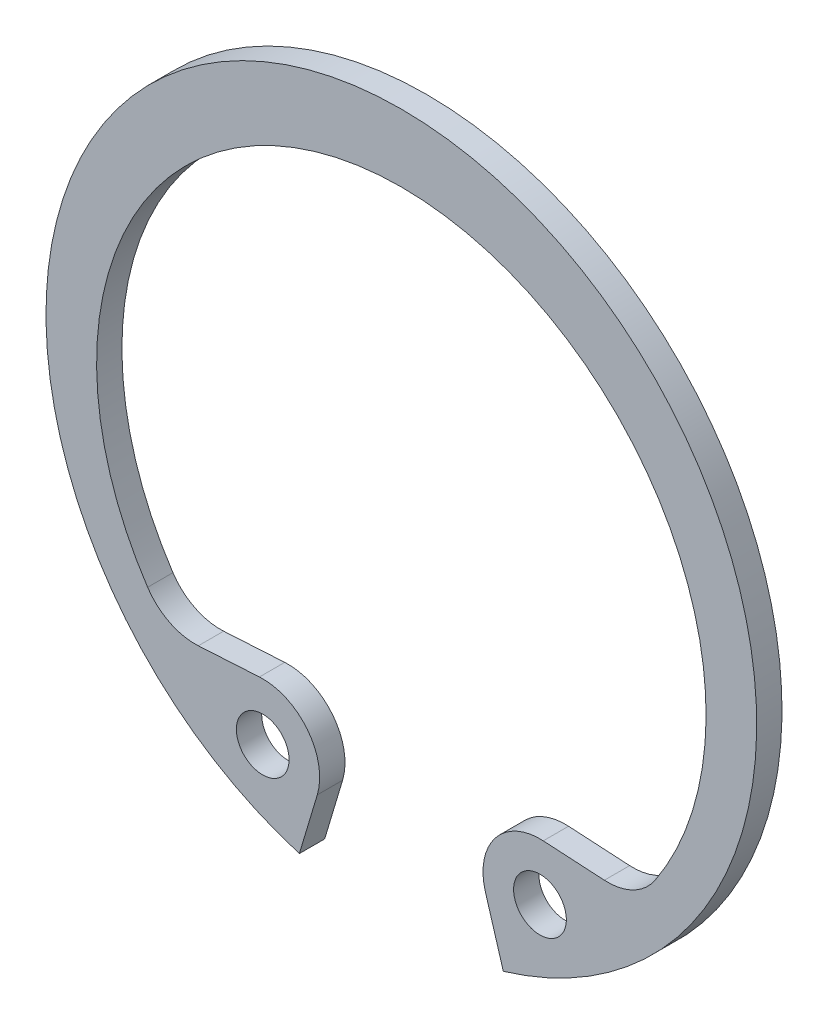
from build123d import *

# Parameters (mm, degrees)
ESQUISSE1_R          = 1.25
BASE_EXTRUSION_DEPTH = 1.2


with BuildPart() as part:
    # Esquisse1 → Base-Extrusion (new body)
    with BuildSketch(Plane.XY):
        with BuildLine():
            Line((3.985998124, -13.3058002), (4.835421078, -16.141288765))
            ThreePointArc((4.835421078, -16.141288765), (0, 16.85), (-4.835421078, -16.141288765))
            Line((-4.835421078, -16.141288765), (-3.985998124, -13.3058002))
            ThreePointArc((-3.985998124, -13.3058002), (-4.454224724, -10.856714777), (-6.728961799, -9.835525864))
            Line((-6.728961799, -9.835525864), (-9.626331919, -10.00377658))
            ThreePointArc((-9.626331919, -10.00377658), (-10.988469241, -9.724202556), (-12.030833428, -8.803845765))
            ThreePointArc((-12.030833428, -8.803845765), (0, 13.65), (12.030833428, -8.803845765))
            ThreePointArc((12.030833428, -8.803845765), (10.988469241, -9.724202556), (9.626331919, -10.00377658))
            Line((9.626331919, -10.00377658), (6.728961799, -9.835525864))
            ThreePointArc((6.728961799, -9.835525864), (4.454224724, -10.856714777), (3.985998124, -13.3058002))
        make_face()
        with Locations(Location((6.572436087, -12.530984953, 0), (0, 0, 180))):
            Circle(ESQUISSE1_R, mode=Mode.SUBTRACT)
        with Locations(Location((-6.572436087, -12.530984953, 0), (0, 0, 180))):
            Circle(ESQUISSE1_R, mode=Mode.SUBTRACT)
    extrude(amount=BASE_EXTRUSION_DEPTH)


solid = part.part
